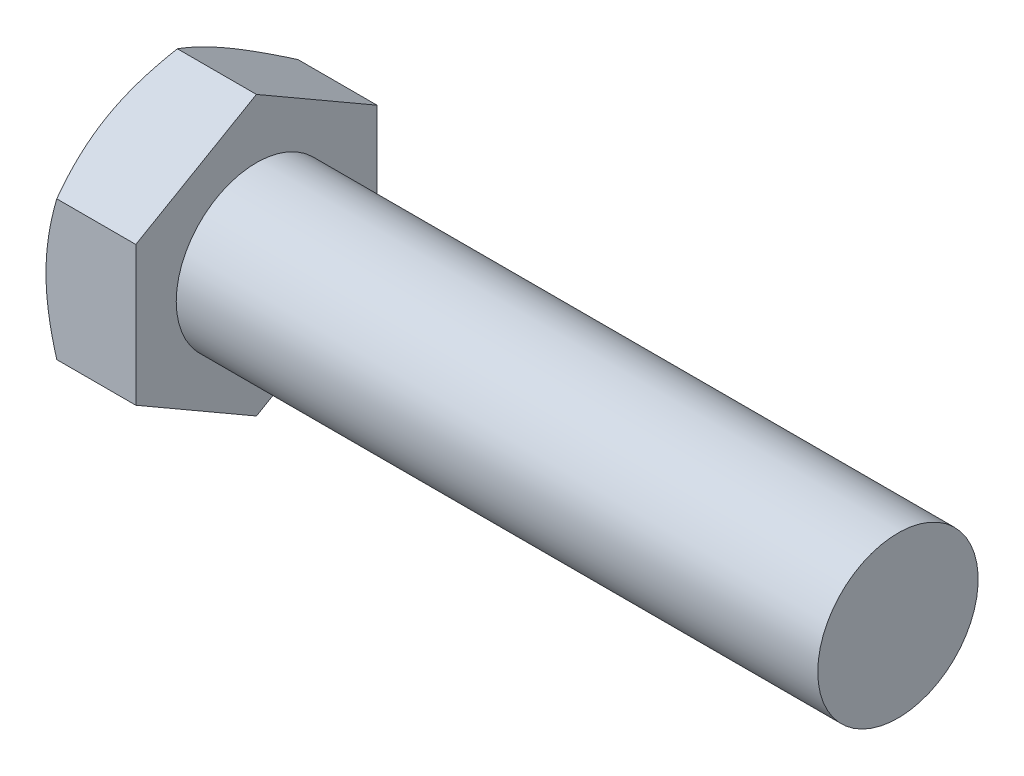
ISO-10303-21;
HEADER;
FILE_DESCRIPTION(('STEP AP214'),'2;1');
FILE_NAME('part.step','',(''),(''),'','','');
FILE_SCHEMA(('AUTOMOTIVE_DESIGN { 1 0 10303 214 1 1 1 1 }'));
ENDSEC;
DATA;
#1=APPLICATION_CONTEXT('core data for automotive mechanical design processes');
#2=APPLICATION_PROTOCOL_DEFINITION('international standard','automotive_design',2000,#1);
#3=PRODUCT_CONTEXT('',#1,'mechanical');
#4=PRODUCT('Part','Part','',(#3));
#5=PRODUCT_RELATED_PRODUCT_CATEGORY('part','',(#4));
#6=PRODUCT_DEFINITION_FORMATION('','',#4);
#7=PRODUCT_DEFINITION_CONTEXT('part definition',#1,'design');
#8=PRODUCT_DEFINITION('design','',#6,#7);
#9=PRODUCT_DEFINITION_SHAPE('','',#8);
#10=(LENGTH_UNIT() NAMED_UNIT(*) SI_UNIT(.MILLI.,.METRE.));
#11=(NAMED_UNIT(*) PLANE_ANGLE_UNIT() SI_UNIT($,.RADIAN.));
#12=(NAMED_UNIT(*) SI_UNIT($,.STERADIAN.) SOLID_ANGLE_UNIT());
#13=UNCERTAINTY_MEASURE_WITH_UNIT(LENGTH_MEASURE(1.E-05),#10,'distance_accuracy_value','');
#14=(GEOMETRIC_REPRESENTATION_CONTEXT(3) GLOBAL_UNCERTAINTY_ASSIGNED_CONTEXT((#13)) GLOBAL_UNIT_ASSIGNED_CONTEXT((#10,
#11,#12)) REPRESENTATION_CONTEXT('',''));
#15=CARTESIAN_POINT('',(0.,0.,0.));
#16=DIRECTION('',(0.,0.,1.));
#17=DIRECTION('',(1.,0.,0.));
#18=AXIS2_PLACEMENT_3D('',#15,#16,#17);
#19=CARTESIAN_POINT('',(0.,0.,0.));
#20=DIRECTION('',(-1.,0.,0.));
#21=DIRECTION('',(0.,0.,1.));
#22=AXIS2_PLACEMENT_3D('',#19,#20,#21);
#23=PLANE('',#22);
#24=CARTESIAN_POINT('',(0.,0.,0.));
#25=DIRECTION('',(-1.,0.,0.));
#26=DIRECTION('',(0.,0.,1.));
#27=AXIS2_PLACEMENT_3D('',#24,#25,#26);
#28=CIRCLE('',#27,2.3876);
#29=CARTESIAN_POINT('',(0.,0.,2.3876));
#30=VERTEX_POINT('',#29);
#31=CARTESIAN_POINT('',(0.,2.06772225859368,1.19380000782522));
#32=VERTEX_POINT('',#31);
#33=EDGE_CURVE('E38',#30,#32,#28,.T.);
#34=ORIENTED_EDGE('',*,*,#33,.T.);
#35=CARTESIAN_POINT('',(0.,2.06772225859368,-1.19380000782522));
#36=VERTEX_POINT('',#35);
#37=EDGE_CURVE('E194',#32,#36,#28,.T.);
#38=ORIENTED_EDGE('',*,*,#37,.T.);
#39=CARTESIAN_POINT('',(0.,0.,-2.3876));
#40=VERTEX_POINT('',#39);
#41=EDGE_CURVE('E199',#36,#40,#28,.T.);
#42=ORIENTED_EDGE('',*,*,#41,.T.);
#43=CARTESIAN_POINT('',(0.,-2.06772225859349,-1.19380000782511));
#44=VERTEX_POINT('',#43);
#45=EDGE_CURVE('E203',#40,#44,#28,.T.);
#46=ORIENTED_EDGE('',*,*,#45,.T.);
#47=CARTESIAN_POINT('',(0.,-2.06772225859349,1.19380000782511));
#48=VERTEX_POINT('',#47);
#49=EDGE_CURVE('E200',#44,#48,#28,.T.);
#50=ORIENTED_EDGE('',*,*,#49,.T.);
#51=EDGE_CURVE('E192',#48,#30,#28,.T.);
#52=ORIENTED_EDGE('',*,*,#51,.T.);
#53=EDGE_LOOP('',(#34,#38,#42,#46,#50,#52));
#54=FACE_BOUND('',#53,.T.);
#55=CARTESIAN_POINT('',(0.,0.,0.));
#56=DIRECTION('',(1.,0.,0.));
#57=DIRECTION('',(0.,0.,-1.));
#58=AXIS2_PLACEMENT_3D('',#55,#56,#57);
#59=CIRCLE('',#58,2.08915);
#60=CARTESIAN_POINT('',(0.,0.,-2.08915));
#61=VERTEX_POINT('',#60);
#62=EDGE_CURVE('E231',#61,#61,#59,.T.);
#63=ORIENTED_EDGE('',*,*,#62,.T.);
#64=EDGE_LOOP('',(#63));
#65=FACE_BOUND('',#64,.T.);
#66=ADVANCED_FACE('F30',(#54,#65),#23,.T.);
#67=CARTESIAN_POINT('',(1.778,1.5875,0.));
#68=DIRECTION('',(-1.,0.,0.));
#69=DIRECTION('',(0.,0.,1.));
#70=AXIS2_PLACEMENT_3D('',#67,#68,#69);
#71=PLANE('',#70);
#72=CARTESIAN_POINT('',(1.778,0.,0.));
#73=DIRECTION('',(-1.,0.,0.));
#74=DIRECTION('',(0.,0.,1.));
#75=AXIS2_PLACEMENT_3D('',#72,#73,#74);
#76=CIRCLE('',#75,1.5875);
#77=CARTESIAN_POINT('',(1.778,0.,1.5875));
#78=VERTEX_POINT('',#77);
#79=EDGE_CURVE('E190',#78,#78,#76,.T.);
#80=ORIENTED_EDGE('',*,*,#79,.T.);
#81=EDGE_LOOP('',(#80));
#82=FACE_BOUND('',#81,.T.);
#83=DIRECTION('',(0.,1.,0.));
#84=VECTOR('',#83,1.);
#85=CARTESIAN_POINT('',(1.778,-1.37848150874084,2.3876));
#86=LINE('',#85,#84);
#87=CARTESIAN_POINT('',(1.778,-1.37848150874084,2.3876));
#88=VERTEX_POINT('',#87);
#89=CARTESIAN_POINT('',(1.778,1.3784815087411,2.3876));
#90=VERTEX_POINT('',#89);
#91=EDGE_CURVE('E53',#88,#90,#86,.T.);
#92=ORIENTED_EDGE('',*,*,#91,.F.);
#93=DIRECTION('',(0.,0.500000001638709,0.86602540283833));
#94=VECTOR('',#93,1.);
#95=CARTESIAN_POINT('',(1.778,-2.75696301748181,0.));
#96=LINE('',#95,#94);
#97=CARTESIAN_POINT('',(1.778,-2.75696301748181,0.));
#98=VERTEX_POINT('',#97);
#99=EDGE_CURVE('E127',#98,#88,#96,.T.);
#100=ORIENTED_EDGE('',*,*,#99,.F.);
#101=DIRECTION('',(0.,-0.50000000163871,0.866025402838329));
#102=VECTOR('',#101,1.);
#103=CARTESIAN_POINT('',(1.778,-1.37848150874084,-2.3876));
#104=LINE('',#103,#102);
#105=CARTESIAN_POINT('',(1.778,-1.37848150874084,-2.3876));
#106=VERTEX_POINT('',#105);
#107=EDGE_CURVE('E125',#106,#98,#104,.T.);
#108=ORIENTED_EDGE('',*,*,#107,.F.);
#109=DIRECTION('',(0.,-1.,0.));
#110=VECTOR('',#109,1.);
#111=CARTESIAN_POINT('',(1.778,1.3784815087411,-2.3876));
#112=LINE('',#111,#110);
#113=CARTESIAN_POINT('',(1.778,1.3784815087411,-2.3876));
#114=VERTEX_POINT('',#113);
#115=EDGE_CURVE('E107',#114,#106,#112,.T.);
#116=ORIENTED_EDGE('',*,*,#115,.F.);
#117=DIRECTION('',(0.,-0.50000000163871,-0.866025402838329));
#118=VECTOR('',#117,1.);
#119=CARTESIAN_POINT('',(1.778,2.75696301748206,0.));
#120=LINE('',#119,#118);
#121=CARTESIAN_POINT('',(1.778,2.75696301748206,0.));
#122=VERTEX_POINT('',#121);
#123=EDGE_CURVE('E116',#122,#114,#120,.T.);
#124=ORIENTED_EDGE('',*,*,#123,.F.);
#125=DIRECTION('',(0.,0.50000000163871,-0.866025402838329));
#126=VECTOR('',#125,1.);
#127=CARTESIAN_POINT('',(1.778,1.3784815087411,2.3876));
#128=LINE('',#127,#126);
#129=EDGE_CURVE('E120',#90,#122,#128,.T.);
#130=ORIENTED_EDGE('',*,*,#129,.F.);
#131=EDGE_LOOP('',(#92,#100,#108,#116,#124,#130));
#132=FACE_BOUND('',#131,.T.);
#133=ADVANCED_FACE('F122',(#82,#132),#71,.F.);
#134=CARTESIAN_POINT('',(-25.4,0.,0.));
#135=DIRECTION('',(-1.,0.,0.));
#136=DIRECTION('',(0.,0.,1.));
#137=AXIS2_PLACEMENT_3D('',#134,#135,#136);
#138=CYLINDRICAL_SURFACE('',#137,1.5875);
#139=CARTESIAN_POINT('',(14.478,0.,0.));
#140=DIRECTION('',(-1.,0.,0.));
#141=DIRECTION('',(0.,0.,1.));
#142=AXIS2_PLACEMENT_3D('',#139,#140,#141);
#143=CIRCLE('',#142,1.5875);
#144=CARTESIAN_POINT('',(14.478,0.,1.5875));
#145=VERTEX_POINT('',#144);
#146=EDGE_CURVE('E11',#145,#145,#143,.T.);
#147=ORIENTED_EDGE('',*,*,#146,.T.);
#148=EDGE_LOOP('',(#147));
#149=FACE_BOUND('',#148,.T.);
#150=ORIENTED_EDGE('',*,*,#79,.F.);
#151=EDGE_LOOP('',(#150));
#152=FACE_BOUND('',#151,.T.);
#153=ADVANCED_FACE('F32',(#149,#152),#138,.T.);
#154=CARTESIAN_POINT('',(14.478,1.5875,0.));
#155=DIRECTION('',(1.,0.,0.));
#156=DIRECTION('',(0.,0.,-1.));
#157=AXIS2_PLACEMENT_3D('',#154,#155,#156);
#158=PLANE('',#157);
#159=ORIENTED_EDGE('',*,*,#146,.F.);
#160=EDGE_LOOP('',(#159));
#161=FACE_BOUND('',#160,.T.);
#162=ADVANCED_FACE('F173',(#161),#158,.T.);
#163=CARTESIAN_POINT('',(1.778,-1.37848150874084,2.3876));
#164=DIRECTION('',(0.,0.,1.));
#165=DIRECTION('',(0.,-1.,0.));
#166=AXIS2_PLACEMENT_3D('',#163,#164,#165);
#167=PLANE('',#166);
#168=DIRECTION('',(-1.,0.,0.));
#169=VECTOR('',#168,1.);
#170=CARTESIAN_POINT('',(1.778,-1.37848150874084,2.3876));
#171=LINE('',#170,#169);
#172=CARTESIAN_POINT('',(0.213251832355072,-1.37848150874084,2.3876));
#173=VERTEX_POINT('',#172);
#174=EDGE_CURVE('E134',#88,#173,#171,.T.);
#175=ORIENTED_EDGE('',*,*,#174,.F.);
#176=ORIENTED_EDGE('',*,*,#91,.T.);
#177=DIRECTION('',(-1.,0.,0.));
#178=VECTOR('',#177,1.);
#179=CARTESIAN_POINT('',(1.778,1.3784815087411,2.3876));
#180=LINE('',#179,#178);
#181=CARTESIAN_POINT('',(0.213251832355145,1.3784815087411,2.3876));
#182=VERTEX_POINT('',#181);
#183=EDGE_CURVE('E133',#90,#182,#180,.T.);
#184=ORIENTED_EDGE('',*,*,#183,.T.);
#185=CARTESIAN_POINT('',(1.14253349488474,-3.65594257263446,2.3876));
#186=CARTESIAN_POINT('',(1.09187421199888,-3.55111338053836,2.3876));
#187=CARTESIAN_POINT('',(1.04171852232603,-3.4460363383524,2.3876));
#188=CARTESIAN_POINT('',(0.942702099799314,-3.23525254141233,2.3876));
#189=CARTESIAN_POINT('',(0.893841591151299,-3.12954568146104,2.3876));
#190=CARTESIAN_POINT('',(0.79744590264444,-2.91679721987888,2.3876));
#191=CARTESIAN_POINT('',(0.74991990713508,-2.809751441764,2.3876));
#192=CARTESIAN_POINT('',(0.656909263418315,-2.59478006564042,2.3876));
#193=CARTESIAN_POINT('',(0.611424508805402,-2.48685451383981,2.3876));
#194=CARTESIAN_POINT('',(0.522499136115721,-2.26861209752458,2.3876));
#195=CARTESIAN_POINT('',(0.479090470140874,-2.15828214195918,2.3876));
#196=CARTESIAN_POINT('',(0.395672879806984,-1.93632088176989,2.3876));
#197=CARTESIAN_POINT('',(0.355664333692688,-1.82468943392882,2.3876));
#198=CARTESIAN_POINT('',(0.280121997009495,-1.60017686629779,2.3876));
#199=CARTESIAN_POINT('',(0.244578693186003,-1.48729898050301,2.3876));
#200=CARTESIAN_POINT('',(0.179121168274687,-1.25993850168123,2.3876));
#201=CARTESIAN_POINT('',(0.149205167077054,-1.14545642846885,2.3876));
#202=CARTESIAN_POINT('',(0.0964545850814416,-0.914809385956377,2.3876));
#203=CARTESIAN_POINT('',(0.0736218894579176,-0.798643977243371,2.3876));
#204=CARTESIAN_POINT('',(0.0365752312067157,-0.564912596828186,2.3876));
#205=CARTESIAN_POINT('',(0.0223612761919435,-0.447346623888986,2.3876));
#206=CARTESIAN_POINT('',(0.00380953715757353,-0.212173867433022,2.3876));
#207=CARTESIAN_POINT('',(-0.000590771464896,-0.0945721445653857,2.3876));
#208=CARTESIAN_POINT('',(0.000718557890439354,0.140548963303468,2.3876));
#209=CARTESIAN_POINT('',(0.00642557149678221,0.258068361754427,2.3876));
#210=CARTESIAN_POINT('',(0.0244000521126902,0.458749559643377,2.3876));
#211=CARTESIAN_POINT('',(0.0343267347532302,0.542132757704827,2.3876));
#212=CARTESIAN_POINT('',(0.0586228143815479,0.708255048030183,2.3876));
#213=CARTESIAN_POINT('',(0.0729929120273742,0.790994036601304,2.3876));
#214=CARTESIAN_POINT('',(0.122014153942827,1.03817723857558,2.3876));
#215=CARTESIAN_POINT('',(0.162563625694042,1.20146282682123,2.3876));
#216=CARTESIAN_POINT('',(0.232500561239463,1.44579488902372,2.3876));
#217=CARTESIAN_POINT('',(0.25768818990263,1.52811494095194,2.3876));
#218=CARTESIAN_POINT('',(0.31055579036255,1.69189584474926,2.3876));
#219=CARTESIAN_POINT('',(0.338234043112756,1.77335724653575,2.3876));
#220=CARTESIAN_POINT('',(0.395506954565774,1.93508020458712,2.3876));
#221=CARTESIAN_POINT('',(0.425089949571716,2.01534593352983,2.3876));
#222=CARTESIAN_POINT('',(0.485992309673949,2.17525463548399,2.3876));
#223=CARTESIAN_POINT('',(0.517312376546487,2.25489734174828,2.3876));
#224=CARTESIAN_POINT('',(0.549329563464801,2.33425207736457,2.3876));
#225=B_SPLINE_CURVE_WITH_KNOTS('',3,(#185,#186,#187,#188,#189,#190,#191,#192,#193,#194,#195,
#196,#197,#198,#199,#200,#201,#202,#203,#204,#205,#206,#207,#208,#209,#210,#211,#212,#213,#214,
#215,#216,#217,#218,#219,#220,#221,#222,#223,#224),.UNSPECIFIED.,.F.,.F.,(4,2,2,2,2,2,2,2,2,2,2,
2,2,2,2,2,2,2,2,4),(0.,0.349289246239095,0.69863856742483,1.04998706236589,1.40131722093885,
1.75696072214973,2.11264373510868,2.46755562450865,2.8223550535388,3.17724882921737,
3.53214291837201,3.88476937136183,4.23730427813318,4.48909732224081,4.74093009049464,
5.2449704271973,5.50321155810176,5.76127579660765,6.01788747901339,6.27460359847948),.UNSPECIFIED.);
#226=EDGE_CURVE('E175',#30,#182,#225,.T.);
#227=ORIENTED_EDGE('',*,*,#226,.F.);
#228=EDGE_CURVE('E182',#173,#30,#225,.T.);
#229=ORIENTED_EDGE('',*,*,#228,.F.);
#230=EDGE_LOOP('',(#175,#176,#184,#227,#229));
#231=FACE_BOUND('',#230,.T.);
#232=ADVANCED_FACE('F169',(#231),#167,.T.);
#233=CARTESIAN_POINT('',(1.778,-2.75696301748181,0.));
#234=DIRECTION('',(0.,-0.86602540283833,0.500000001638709));
#235=DIRECTION('',(0.,-0.500000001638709,-0.866025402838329));
#236=AXIS2_PLACEMENT_3D('',#233,#234,#235);
#237=PLANE('',#236);
#238=DIRECTION('',(-1.,0.,0.));
#239=VECTOR('',#238,1.);
#240=CARTESIAN_POINT('',(1.778,-2.75696301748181,0.));
#241=LINE('',#240,#239);
#242=CARTESIAN_POINT('',(0.213251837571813,-2.75696301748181,0.));
#243=VERTEX_POINT('',#242);
#244=EDGE_CURVE('E138',#98,#243,#241,.T.);
#245=ORIENTED_EDGE('',*,*,#244,.F.);
#246=ORIENTED_EDGE('',*,*,#99,.T.);
#247=ORIENTED_EDGE('',*,*,#174,.T.);
#248=CARTESIAN_POINT('',(0.213318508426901,-2.75707848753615,-0.000200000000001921));
#249=CARTESIAN_POINT('',(0.178329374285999,-2.69650062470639,0.104723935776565));
#250=CARTESIAN_POINT('',(0.14650775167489,-2.63539985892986,0.210553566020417));
#251=CARTESIAN_POINT('',(0.090962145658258,-2.51214024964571,0.424045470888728));
#252=CARTESIAN_POINT('',(0.0672578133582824,-2.44997921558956,0.5317115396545));
#253=CARTESIAN_POINT('',(0.0303576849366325,-2.32642753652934,0.745709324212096));
#254=CARTESIAN_POINT('',(0.0169163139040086,-2.26505590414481,0.852008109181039));
#255=CARTESIAN_POINT('',(0.000868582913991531,-2.14202378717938,1.0651059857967));
#256=CARTESIAN_POINT('',(-0.00175106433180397,-2.08036374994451,1.1719043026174));
#257=CARTESIAN_POINT('',(0.00369159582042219,-1.96514336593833,1.3714718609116));
#258=CARTESIAN_POINT('',(0.0104175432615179,-1.91156579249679,1.46427093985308));
#259=CARTESIAN_POINT('',(0.0317370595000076,-1.80475971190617,1.64926449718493));
#260=CARTESIAN_POINT('',(0.0463379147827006,-1.75153157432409,1.74145833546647));
#261=CARTESIAN_POINT('',(0.0828397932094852,-1.64450518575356,1.92683347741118));
#262=CARTESIAN_POINT('',(0.104895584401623,-1.5907204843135,2.0199913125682));
#263=CARTESIAN_POINT('',(0.154953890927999,-1.48395338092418,2.20491735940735));
#264=CARTESIAN_POINT('',(0.182944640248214,-1.43096961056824,2.29668794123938));
#265=CARTESIAN_POINT('',(0.213318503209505,-1.3783660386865,2.3878));
#266=B_SPLINE_CURVE_WITH_KNOTS('',3,(#248,#249,#250,#251,#252,#253,#254,#255,#256,#257,#258,
#259,#260,#261,#262,#263,#264,#265),.UNSPECIFIED.,.F.,.F.,(4,2,2,2,2,2,2,2,4),(0.,
0.378469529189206,0.757848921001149,1.12783830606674,1.49737327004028,1.81916504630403,
2.1412550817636,2.47049068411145,2.79907958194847),.UNSPECIFIED.);
#267=EDGE_CURVE('E184',#48,#173,#266,.T.);
#268=ORIENTED_EDGE('',*,*,#267,.F.);
#269=EDGE_CURVE('E183',#243,#48,#266,.T.);
#270=ORIENTED_EDGE('',*,*,#269,.F.);
#271=EDGE_LOOP('',(#245,#246,#247,#268,#270));
#272=FACE_BOUND('',#271,.T.);
#273=ADVANCED_FACE('F172',(#272),#237,.T.);
#274=CARTESIAN_POINT('',(1.778,-1.37848150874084,-2.3876));
#275=DIRECTION('',(0.,-0.866025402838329,-0.50000000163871));
#276=DIRECTION('',(0.,0.50000000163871,-0.866025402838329));
#277=AXIS2_PLACEMENT_3D('',#274,#275,#276);
#278=PLANE('',#277);
#279=DIRECTION('',(-1.,0.,0.));
#280=VECTOR('',#279,1.);
#281=CARTESIAN_POINT('',(1.778,-1.37848150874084,-2.3876));
#282=LINE('',#281,#280);
#283=CARTESIAN_POINT('',(0.213251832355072,-1.37848150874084,-2.3876));
#284=VERTEX_POINT('',#283);
#285=EDGE_CURVE('E113',#106,#284,#282,.T.);
#286=ORIENTED_EDGE('',*,*,#285,.F.);
#287=ORIENTED_EDGE('',*,*,#107,.T.);
#288=ORIENTED_EDGE('',*,*,#244,.T.);
#289=CARTESIAN_POINT('',(0.213318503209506,-1.3783660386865,-2.3878));
#290=CARTESIAN_POINT('',(0.178329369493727,-1.43894390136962,-2.2828760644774));
#291=CARTESIAN_POINT('',(0.146507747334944,-1.50004466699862,-2.17704643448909));
#292=CARTESIAN_POINT('',(0.0909621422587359,-1.62330427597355,-1.96355453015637));
#293=CARTESIAN_POINT('',(0.0672578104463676,-1.68546530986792,-1.8558884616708));
#294=CARTESIAN_POINT('',(0.0303576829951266,-1.80901698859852,-1.64189067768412));
#295=CARTESIAN_POINT('',(0.0169163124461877,-1.87038862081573,-1.53559189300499));
#296=CARTESIAN_POINT('',(0.000868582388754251,-1.99342073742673,-1.32249401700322));
#297=CARTESIAN_POINT('',(-0.0017510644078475,-2.05508077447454,-1.21569570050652));
#298=CARTESIAN_POINT('',(0.00369159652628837,-2.17030115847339,-1.01612814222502));
#299=CARTESIAN_POINT('',(0.0104175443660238,-2.22387873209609,-0.923329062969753));
#300=CARTESIAN_POINT('',(0.0317370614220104,-2.33068481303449,-0.738335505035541));
#301=CARTESIAN_POINT('',(0.0463379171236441,-2.38391295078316,-0.646141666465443));
#302=CARTESIAN_POINT('',(0.0828397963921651,-2.4909393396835,-0.460766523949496));
#303=CARTESIAN_POINT('',(0.10489558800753,-2.54472404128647,-0.367608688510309));
#304=CARTESIAN_POINT('',(0.154953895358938,-2.65149114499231,-0.182682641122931));
#305=CARTESIAN_POINT('',(0.18294464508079,-2.7044749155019,-0.0909120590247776));
#306=CARTESIAN_POINT('',(0.213318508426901,-2.75707848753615,0.00019999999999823));
#307=B_SPLINE_CURVE_WITH_KNOTS('',3,(#289,#290,#291,#292,#293,#294,#295,#296,#297,#298,#299,
#300,#301,#302,#303,#304,#305,#306),.UNSPECIFIED.,.F.,.F.,(4,2,2,2,2,2,2,2,4),(0.,
0.378469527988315,0.757848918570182,1.12783830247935,1.49737326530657,1.81916504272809,
2.14125507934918,2.47049068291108,2.79907958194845),.UNSPECIFIED.);
#308=EDGE_CURVE('E213',#44,#243,#307,.T.);
#309=ORIENTED_EDGE('',*,*,#308,.F.);
#310=EDGE_CURVE('E218',#284,#44,#307,.T.);
#311=ORIENTED_EDGE('',*,*,#310,.F.);
#312=EDGE_LOOP('',(#286,#287,#288,#309,#311));
#313=FACE_BOUND('',#312,.T.);
#314=ADVANCED_FACE('F290',(#313),#278,.T.);
#315=CARTESIAN_POINT('',(1.778,1.3784815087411,-2.3876));
#316=DIRECTION('',(0.,0.,-1.));
#317=DIRECTION('',(-1.,0.,0.));
#318=AXIS2_PLACEMENT_3D('',#315,#316,#317);
#319=PLANE('',#318);
#320=DIRECTION('',(-1.,0.,0.));
#321=VECTOR('',#320,1.);
#322=CARTESIAN_POINT('',(1.778,1.3784815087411,-2.3876));
#323=LINE('',#322,#321);
#324=CARTESIAN_POINT('',(0.213251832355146,1.3784815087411,-2.3876));
#325=VERTEX_POINT('',#324);
#326=EDGE_CURVE('E102',#114,#325,#323,.T.);
#327=ORIENTED_EDGE('',*,*,#326,.F.);
#328=ORIENTED_EDGE('',*,*,#115,.T.);
#329=ORIENTED_EDGE('',*,*,#285,.T.);
#330=CARTESIAN_POINT('',(1.14253349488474,-3.65594257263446,-2.3876));
#331=CARTESIAN_POINT('',(1.09187421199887,-3.55111338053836,-2.3876));
#332=CARTESIAN_POINT('',(1.04171852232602,-3.4460363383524,-2.3876));
#333=CARTESIAN_POINT('',(0.942702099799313,-3.23525254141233,-2.3876));
#334=CARTESIAN_POINT('',(0.893841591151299,-3.12954568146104,-2.3876));
#335=CARTESIAN_POINT('',(0.79744590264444,-2.91679721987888,-2.3876));
#336=CARTESIAN_POINT('',(0.749919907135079,-2.80975144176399,-2.3876));
#337=CARTESIAN_POINT('',(0.656909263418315,-2.59478006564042,-2.3876));
#338=CARTESIAN_POINT('',(0.611424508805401,-2.48685451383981,-2.3876));
#339=CARTESIAN_POINT('',(0.52249913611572,-2.26861209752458,-2.3876));
#340=CARTESIAN_POINT('',(0.479090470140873,-2.15828214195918,-2.3876));
#341=CARTESIAN_POINT('',(0.395672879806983,-1.93632088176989,-2.3876));
#342=CARTESIAN_POINT('',(0.355664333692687,-1.82468943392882,-2.3876));
#343=CARTESIAN_POINT('',(0.280121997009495,-1.60017686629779,-2.3876));
#344=CARTESIAN_POINT('',(0.244578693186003,-1.48729898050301,-2.3876));
#345=CARTESIAN_POINT('',(0.179121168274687,-1.25993850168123,-2.3876));
#346=CARTESIAN_POINT('',(0.149205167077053,-1.14545642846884,-2.3876));
#347=CARTESIAN_POINT('',(0.0964545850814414,-0.914809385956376,-2.3876));
#348=CARTESIAN_POINT('',(0.0736218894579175,-0.79864397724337,-2.3876));
#349=CARTESIAN_POINT('',(0.0365752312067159,-0.564912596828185,-2.3876));
#350=CARTESIAN_POINT('',(0.0223612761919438,-0.447346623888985,-2.3876));
#351=CARTESIAN_POINT('',(0.003809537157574,-0.212173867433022,-2.3876));
#352=CARTESIAN_POINT('',(-0.000590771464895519,-0.0945721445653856,-2.3876));
#353=CARTESIAN_POINT('',(0.000718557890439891,0.140548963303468,-2.3876));
#354=CARTESIAN_POINT('',(0.0064255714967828,0.258068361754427,-2.3876));
#355=CARTESIAN_POINT('',(0.0244000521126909,0.458749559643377,-2.3876));
#356=CARTESIAN_POINT('',(0.0343267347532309,0.542132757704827,-2.3876));
#357=CARTESIAN_POINT('',(0.0586228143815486,0.708255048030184,-2.3876));
#358=CARTESIAN_POINT('',(0.072992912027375,0.790994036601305,-2.3876));
#359=CARTESIAN_POINT('',(0.122014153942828,1.03817723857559,-2.3876));
#360=CARTESIAN_POINT('',(0.162563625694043,1.20146282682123,-2.3876));
#361=CARTESIAN_POINT('',(0.232500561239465,1.44579488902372,-2.3876));
#362=CARTESIAN_POINT('',(0.257688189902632,1.52811494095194,-2.3876));
#363=CARTESIAN_POINT('',(0.310555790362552,1.69189584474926,-2.3876));
#364=CARTESIAN_POINT('',(0.338234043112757,1.77335724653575,-2.3876));
#365=CARTESIAN_POINT('',(0.395506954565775,1.93508020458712,-2.3876));
#366=CARTESIAN_POINT('',(0.425089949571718,2.01534593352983,-2.3876));
#367=CARTESIAN_POINT('',(0.485992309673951,2.175254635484,-2.3876));
#368=CARTESIAN_POINT('',(0.517312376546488,2.25489734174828,-2.3876));
#369=CARTESIAN_POINT('',(0.549329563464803,2.33425207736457,-2.3876));
#370=B_SPLINE_CURVE_WITH_KNOTS('',3,(#330,#331,#332,#333,#334,#335,#336,#337,#338,#339,#340,
#341,#342,#343,#344,#345,#346,#347,#348,#349,#350,#351,#352,#353,#354,#355,#356,#357,#358,#359,
#360,#361,#362,#363,#364,#365,#366,#367,#368,#369),.UNSPECIFIED.,.F.,.F.,(4,2,2,2,2,2,2,2,2,2,2,
2,2,2,2,2,2,2,2,4),(0.,0.349289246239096,0.69863856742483,1.04998706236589,1.40131722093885,
1.75696072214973,2.11264373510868,2.46755562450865,2.8223550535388,3.17724882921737,
3.53214291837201,3.88476937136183,4.23730427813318,4.48909732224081,4.74093009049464,
5.2449704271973,5.50321155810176,5.76127579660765,6.01788747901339,6.27460359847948),.UNSPECIFIED.);
#371=EDGE_CURVE('E214',#40,#284,#370,.F.);
#372=ORIENTED_EDGE('',*,*,#371,.F.);
#373=EDGE_CURVE('E110',#325,#40,#370,.F.);
#374=ORIENTED_EDGE('',*,*,#373,.F.);
#375=EDGE_LOOP('',(#327,#328,#329,#372,#374));
#376=FACE_BOUND('',#375,.T.);
#377=ADVANCED_FACE('F104',(#376),#319,.T.);
#378=CARTESIAN_POINT('',(1.778,2.75696301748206,0.));
#379=DIRECTION('',(0.,0.866025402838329,-0.50000000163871));
#380=DIRECTION('',(0.,0.50000000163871,0.866025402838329));
#381=AXIS2_PLACEMENT_3D('',#378,#379,#380);
#382=PLANE('',#381);
#383=DIRECTION('',(-1.,0.,0.));
#384=VECTOR('',#383,1.);
#385=CARTESIAN_POINT('',(1.778,2.75696301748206,0.));
#386=LINE('',#385,#384);
#387=CARTESIAN_POINT('',(0.213251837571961,2.75696301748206,0.));
#388=VERTEX_POINT('',#387);
#389=EDGE_CURVE('E45',#122,#388,#386,.T.);
#390=ORIENTED_EDGE('',*,*,#389,.F.);
#391=ORIENTED_EDGE('',*,*,#123,.T.);
#392=ORIENTED_EDGE('',*,*,#326,.T.);
#393=CARTESIAN_POINT('',(0.21331850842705,2.75707848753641,0.000199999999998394));
#394=CARTESIAN_POINT('',(0.178329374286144,2.69650062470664,-0.104723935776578));
#395=CARTESIAN_POINT('',(0.146507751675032,2.63539985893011,-0.21055356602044));
#396=CARTESIAN_POINT('',(0.0909621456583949,2.51214024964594,-0.424045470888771));
#397=CARTESIAN_POINT('',(0.0672578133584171,2.44997921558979,-0.531711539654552));
#398=CARTESIAN_POINT('',(0.0303576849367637,2.32642753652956,-0.745709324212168));
#399=CARTESIAN_POINT('',(0.0169163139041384,2.26505590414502,-0.852008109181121));
#400=CARTESIAN_POINT('',(0.000868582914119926,2.14202378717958,-1.0651059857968));
#401=CARTESIAN_POINT('',(-0.00175106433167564,2.0803637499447,-1.17190430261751));
#402=CARTESIAN_POINT('',(0.00369159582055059,1.96514336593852,-1.37147186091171));
#403=CARTESIAN_POINT('',(0.0104175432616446,1.91156579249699,-1.46427093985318));
#404=CARTESIAN_POINT('',(0.0317370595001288,1.80475971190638,-1.64926449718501));
#405=CARTESIAN_POINT('',(0.0463379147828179,1.75153157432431,-1.74145833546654));
#406=CARTESIAN_POINT('',(0.0828397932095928,1.64450518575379,-1.92683347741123));
#407=CARTESIAN_POINT('',(0.104895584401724,1.59072048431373,-2.01999131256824));
#408=CARTESIAN_POINT('',(0.154953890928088,1.48395338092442,-2.20491735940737));
#409=CARTESIAN_POINT('',(0.182944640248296,1.43096961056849,-2.29668794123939));
#410=CARTESIAN_POINT('',(0.213318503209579,1.37836603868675,-2.3878));
#411=B_SPLINE_CURVE_WITH_KNOTS('',3,(#393,#394,#395,#396,#397,#398,#399,#400,#401,#402,#403,
#404,#405,#406,#407,#408,#409,#410),.UNSPECIFIED.,.F.,.F.,(4,2,2,2,2,2,2,2,4),(0.,
0.378469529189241,0.75784892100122,1.12783830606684,1.49737327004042,1.81916504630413,
2.14125508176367,2.47049068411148,2.79907958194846),.UNSPECIFIED.);
#412=EDGE_CURVE('E152',#36,#325,#411,.T.);
#413=ORIENTED_EDGE('',*,*,#412,.F.);
#414=EDGE_CURVE('E377',#388,#36,#411,.T.);
#415=ORIENTED_EDGE('',*,*,#414,.F.);
#416=EDGE_LOOP('',(#390,#391,#392,#413,#415));
#417=FACE_BOUND('',#416,.T.);
#418=ADVANCED_FACE('F117',(#417),#382,.T.);
#419=CARTESIAN_POINT('',(1.778,1.3784815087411,2.3876));
#420=DIRECTION('',(0.,0.866025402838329,0.50000000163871));
#421=DIRECTION('',(0.,-0.50000000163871,0.866025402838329));
#422=AXIS2_PLACEMENT_3D('',#419,#420,#421);
#423=PLANE('',#422);
#424=ORIENTED_EDGE('',*,*,#183,.F.);
#425=ORIENTED_EDGE('',*,*,#129,.T.);
#426=ORIENTED_EDGE('',*,*,#389,.T.);
#427=CARTESIAN_POINT('',(0.213318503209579,1.37836603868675,2.3878));
#428=CARTESIAN_POINT('',(0.178329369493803,1.43894390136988,2.2828760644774));
#429=CARTESIAN_POINT('',(0.146507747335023,1.50004466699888,2.17704643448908));
#430=CARTESIAN_POINT('',(0.0909621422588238,1.62330427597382,1.96355453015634));
#431=CARTESIAN_POINT('',(0.0672578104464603,1.68546530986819,1.85588846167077));
#432=CARTESIAN_POINT('',(0.0303576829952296,1.8090169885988,1.64189067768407));
#433=CARTESIAN_POINT('',(0.0169163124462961,1.87038862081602,1.53559189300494));
#434=CARTESIAN_POINT('',(0.000868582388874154,1.99342073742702,1.32249401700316));
#435=CARTESIAN_POINT('',(-0.00175106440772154,2.05508077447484,1.21569570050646));
#436=CARTESIAN_POINT('',(0.00369159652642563,2.17030115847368,1.01612814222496));
#437=CARTESIAN_POINT('',(0.0104175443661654,2.22387873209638,0.923329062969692));
#438=CARTESIAN_POINT('',(0.0317370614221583,2.33068481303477,0.738335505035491));
#439=CARTESIAN_POINT('',(0.046337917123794,2.38391295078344,0.646141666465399));
#440=CARTESIAN_POINT('',(0.0828397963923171,2.49093933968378,0.460766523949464));
#441=CARTESIAN_POINT('',(0.104895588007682,2.54472404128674,0.367608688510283));
#442=CARTESIAN_POINT('',(0.154953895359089,2.65149114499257,0.182682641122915));
#443=CARTESIAN_POINT('',(0.18294464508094,2.70447491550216,0.0909120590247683));
#444=CARTESIAN_POINT('',(0.213318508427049,2.75707848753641,-0.000200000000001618));
#445=B_SPLINE_CURVE_WITH_KNOTS('',3,(#427,#428,#429,#430,#431,#432,#433,#434,#435,#436,#437,
#438,#439,#440,#441,#442,#443,#444),.UNSPECIFIED.,.F.,.F.,(4,2,2,2,2,2,2,2,4),(0.,
0.378469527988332,0.757848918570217,1.12783830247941,1.49737326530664,1.81916504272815,
2.14125507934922,2.47049068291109,2.79907958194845),.UNSPECIFIED.);
#446=EDGE_CURVE('E137',#32,#388,#445,.T.);
#447=ORIENTED_EDGE('',*,*,#446,.F.);
#448=EDGE_CURVE('E151',#182,#32,#445,.T.);
#449=ORIENTED_EDGE('',*,*,#448,.F.);
#450=EDGE_LOOP('',(#424,#425,#426,#447,#449));
#451=FACE_BOUND('',#450,.T.);
#452=ADVANCED_FACE('F162',(#451),#423,.T.);
#453=CARTESIAN_POINT('',(0.,0.,0.));
#454=DIRECTION('',(1.,0.,0.));
#455=DIRECTION('',(0.,0.,-1.));
#456=AXIS2_PLACEMENT_3D('',#453,#454,#455);
#457=CONICAL_SURFACE('',#456,2.3876,1.0471975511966);
#458=ORIENTED_EDGE('',*,*,#51,.F.);
#459=ORIENTED_EDGE('',*,*,#267,.T.);
#460=ORIENTED_EDGE('',*,*,#228,.T.);
#461=EDGE_LOOP('',(#458,#459,#460));
#462=FACE_BOUND('',#461,.T.);
#463=ADVANCED_FACE('F166',(#462),#457,.T.);
#464=ORIENTED_EDGE('',*,*,#49,.F.);
#465=ORIENTED_EDGE('',*,*,#308,.T.);
#466=ORIENTED_EDGE('',*,*,#269,.T.);
#467=EDGE_LOOP('',(#464,#465,#466));
#468=FACE_BOUND('',#467,.T.);
#469=ADVANCED_FACE('F223',(#468),#457,.T.);
#470=ORIENTED_EDGE('',*,*,#371,.T.);
#471=ORIENTED_EDGE('',*,*,#310,.T.);
#472=ORIENTED_EDGE('',*,*,#45,.F.);
#473=EDGE_LOOP('',(#470,#471,#472));
#474=FACE_BOUND('',#473,.T.);
#475=ADVANCED_FACE('F158',(#474),#457,.T.);
#476=ORIENTED_EDGE('',*,*,#412,.T.);
#477=ORIENTED_EDGE('',*,*,#373,.T.);
#478=ORIENTED_EDGE('',*,*,#41,.F.);
#479=EDGE_LOOP('',(#476,#477,#478));
#480=FACE_BOUND('',#479,.T.);
#481=ADVANCED_FACE('F212',(#480),#457,.T.);
#482=ORIENTED_EDGE('',*,*,#33,.F.);
#483=ORIENTED_EDGE('',*,*,#226,.T.);
#484=ORIENTED_EDGE('',*,*,#448,.T.);
#485=EDGE_LOOP('',(#482,#483,#484));
#486=FACE_BOUND('',#485,.T.);
#487=ADVANCED_FACE('F249',(#486),#457,.T.);
#488=ORIENTED_EDGE('',*,*,#446,.T.);
#489=ORIENTED_EDGE('',*,*,#414,.T.);
#490=ORIENTED_EDGE('',*,*,#37,.F.);
#491=EDGE_LOOP('',(#488,#489,#490));
#492=FACE_BOUND('',#491,.T.);
#493=ADVANCED_FACE('F240',(#492),#457,.T.);
#494=CARTESIAN_POINT('',(0.22225,0.,0.));
#495=DIRECTION('',(-1.,0.,0.));
#496=DIRECTION('',(0.,0.,1.));
#497=AXIS2_PLACEMENT_3D('',#494,#495,#496);
#498=CYLINDRICAL_SURFACE('',#497,2.08915);
#499=CARTESIAN_POINT('',(0.22225,0.,0.));
#500=DIRECTION('',(1.,0.,0.));
#501=DIRECTION('',(0.,0.,-1.));
#502=AXIS2_PLACEMENT_3D('',#499,#500,#501);
#503=CIRCLE('',#502,2.08915);
#504=CARTESIAN_POINT('',(0.22225,0.,-2.08915));
#505=VERTEX_POINT('',#504);
#506=EDGE_CURVE('E228',#505,#505,#503,.T.);
#507=ORIENTED_EDGE('',*,*,#506,.T.);
#508=EDGE_LOOP('',(#507));
#509=FACE_BOUND('',#508,.T.);
#510=ORIENTED_EDGE('',*,*,#62,.F.);
#511=EDGE_LOOP('',(#510));
#512=FACE_BOUND('',#511,.T.);
#513=ADVANCED_FACE('F237',(#509,#512),#498,.F.);
#514=CARTESIAN_POINT('',(0.22225,0.,0.));
#515=DIRECTION('',(1.,0.,0.));
#516=DIRECTION('',(0.,0.,-1.));
#517=AXIS2_PLACEMENT_3D('',#514,#515,#516);
#518=PLANE('',#517);
#519=ORIENTED_EDGE('',*,*,#506,.F.);
#520=EDGE_LOOP('',(#519));
#521=FACE_BOUND('',#520,.T.);
#522=ADVANCED_FACE('F239',(#521),#518,.F.);
#523=CLOSED_SHELL('',(#66,#133,#153,#162,#232,#273,#314,#377,#418,#452,#463,#469,#475,#481,#487,
#493,#513,#522));
#524=MANIFOLD_SOLID_BREP('B2',#523);
#525=ADVANCED_BREP_SHAPE_REPRESENTATION('',(#18,#524),#14);
#526=SHAPE_DEFINITION_REPRESENTATION(#9,#525);
ENDSEC;
END-ISO-10303-21;
